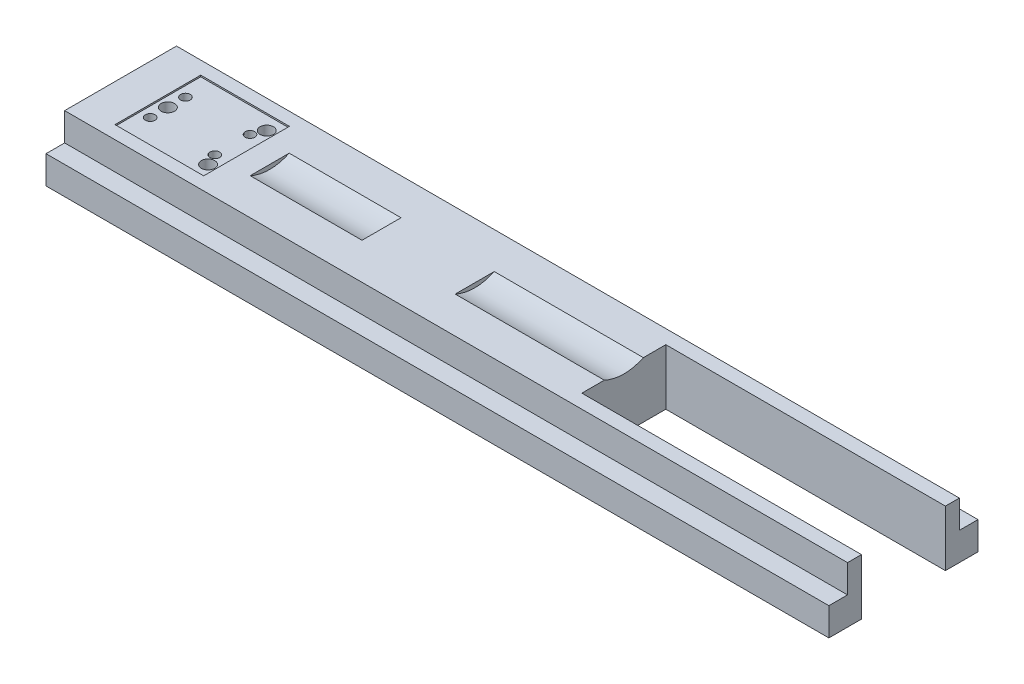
from build123d import *

# Parameters (mm, degrees)
SKETCH1_W           = 266.7
SKETCH1_H           = 50.8
BOSS_EXTRUDE1_DEPTH = 19.05
SKETCH2_W           = 30.226
SKETCH2_H           = 29.21
CUT_EXTRUDE1_DEPTH  = 0.508
SKETCH3_R           = 2.286
SKETCH3_R_2         = 1.651
CUT_EXTRUDE2_DEPTH  = 273.127425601
CUT_EXTRUDE3_START  = -19.05
SKETCH5_R           = 15.494
CUT_EXTRUDE3_DEPTH  = 127
SKETCH6_W           = 6.35
SKETCH6_H           = 9.525
CUT_EXTRUDE4_DEPTH  = 273.162511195
SKETCH7_W           = 28.6004
SKETCH7_H           = 19.05
CUT_EXTRUDE5_DEPTH  = 95.25
CUT_EXTRUDE6_START  = -177.8
SKETCH8_R           = 15.494
CUT_EXTRUDE6_DEPTH  = 38.1
SKETCH9_W           = 39.7002
SKETCH9_H           = 34.9504
CUT_EXTRUDE7_DEPTH  = 3.9624


with BuildPart() as part:
    # Sketch1 → Boss-Extrude1 (new body)
    with BuildSketch(Plane(origin=(0, 0, 0), x_dir=(1, 0, 0), z_dir=(0, 1, 0))):
        with Locations((133.35, -25.4)):
            Rectangle(SKETCH1_W, SKETCH1_H)
    extrude(amount=-BOSS_EXTRUDE1_DEPTH)

    # Sketch2 → Cut-Extrude1 (cut)
    with BuildSketch(Plane(origin=(0, 0, 0), x_dir=(1, 0, 0), z_dir=(0, 1, 0))):
        with Locations((27.813, -25.4)):
            Rectangle(SKETCH2_W, SKETCH2_H)
    extrude(amount=-CUT_EXTRUDE1_DEPTH, mode=Mode.SUBTRACT)

    # Sketch3 → Cut-Extrude2 (cut, through all)
    with BuildSketch(Plane(origin=(0, -0.508, 0), x_dir=(1, 0, 0), z_dir=(0, 1, 0))):
        with Locations(Location((16.1036, -25.4, 0), (0, 0, 270))):
            Circle(SKETCH3_R)
        with Locations(Location((16.1036, -19.4056, 0), (0, 0, 270))):
            Circle(SKETCH3_R_2)
        with Locations(Location((16.1036, -31.3944, 0), (0, 0, 270))):
            Circle(SKETCH3_R_2)
        with Locations(Location((39.8018, -15.4051, 0), (0, 0, 270))):
            Circle(SKETCH3_R)
        with Locations(Location((39.8018, -35.3949, 0), (0, 0, 270))):
            Circle(SKETCH3_R)
        with Locations(Location((38.1, -19.4056, 0), (0, 0, 270))):
            Circle(SKETCH3_R_2)
        with Locations(Location((38.1, -31.3944, 0), (0, 0, 270))):
            Circle(SKETCH3_R_2)
    extrude(amount=-CUT_EXTRUDE2_DEPTH, mode=Mode.SUBTRACT)

    # Sketch5 → Cut-Extrude3 (cut)
    with BuildSketch(Plane(origin=(266.7, 0, 0), x_dir=(0, 0, -1), z_dir=(1, 0, 0)).offset(CUT_EXTRUDE3_START)):
        with Locations((-25.4, 13.9954)):
            Circle(SKETCH5_R)
    extrude(amount=-CUT_EXTRUDE3_DEPTH, mode=Mode.SUBTRACT)

    # Sketch6 → Cut-Extrude4 (cut, through all)
    with BuildSketch(Plane(origin=(266.7, 0, 0), x_dir=(0, 0, -1), z_dir=(1, 0, 0))):
        with Locations((-47.625, -4.7625)):
            Rectangle(SKETCH6_W, SKETCH6_H)
        with Locations((-3.175, -4.7625)):
            Rectangle(SKETCH6_W, SKETCH6_H)
    extrude(amount=-CUT_EXTRUDE4_DEPTH, mode=Mode.SUBTRACT)

    # Sketch7 → Cut-Extrude5 (cut)
    with BuildSketch(Plane(origin=(266.7, 0, 0), x_dir=(0, 0, -1), z_dir=(1, 0, 0))):
        with Locations((-25.4, -9.525)):
            Rectangle(SKETCH7_W, SKETCH7_H)
    extrude(amount=-CUT_EXTRUDE5_DEPTH, mode=Mode.SUBTRACT)

    # Sketch8 → Cut-Extrude6 (cut)
    with BuildSketch(Plane(origin=(266.7, 0, 0), x_dir=(0, 0, -1), z_dir=(1, 0, 0)).offset(CUT_EXTRUDE6_START)):
        with Locations((-25.4, 13.9954)):
            Circle(SKETCH8_R)
    extrude(amount=-CUT_EXTRUDE6_DEPTH, mode=Mode.SUBTRACT)

    # Sketch9 → Cut-Extrude7 (cut)
    with BuildSketch(Plane.XZ.offset(19.05)):
        with Locations((27.7749, 25.4)):
            Rectangle(SKETCH9_W, SKETCH9_H)
    extrude(amount=-CUT_EXTRUDE7_DEPTH, mode=Mode.SUBTRACT)


solid = part.part
